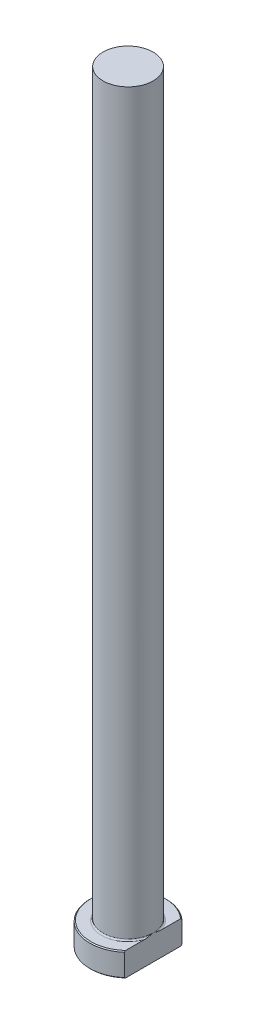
ISO-10303-21;
HEADER;
FILE_DESCRIPTION(('STEP AP214'),'2;1');
FILE_NAME('part.step','',(''),(''),'','','');
FILE_SCHEMA(('AUTOMOTIVE_DESIGN { 1 0 10303 214 1 1 1 1 }'));
ENDSEC;
DATA;
#1=APPLICATION_CONTEXT('core data for automotive mechanical design processes');
#2=APPLICATION_PROTOCOL_DEFINITION('international standard','automotive_design',2000,#1);
#3=PRODUCT_CONTEXT('',#1,'mechanical');
#4=PRODUCT('Part','Part','',(#3));
#5=PRODUCT_RELATED_PRODUCT_CATEGORY('part','',(#4));
#6=PRODUCT_DEFINITION_FORMATION('','',#4);
#7=PRODUCT_DEFINITION_CONTEXT('part definition',#1,'design');
#8=PRODUCT_DEFINITION('design','',#6,#7);
#9=PRODUCT_DEFINITION_SHAPE('','',#8);
#10=(LENGTH_UNIT() NAMED_UNIT(*) SI_UNIT(.MILLI.,.METRE.));
#11=(NAMED_UNIT(*) PLANE_ANGLE_UNIT() SI_UNIT($,.RADIAN.));
#12=(NAMED_UNIT(*) SI_UNIT($,.STERADIAN.) SOLID_ANGLE_UNIT());
#13=UNCERTAINTY_MEASURE_WITH_UNIT(LENGTH_MEASURE(1.E-05),#10,'distance_accuracy_value','');
#14=(GEOMETRIC_REPRESENTATION_CONTEXT(3) GLOBAL_UNCERTAINTY_ASSIGNED_CONTEXT((#13)) GLOBAL_UNIT_ASSIGNED_CONTEXT((#10,
#11,#12)) REPRESENTATION_CONTEXT('',''));
#15=CARTESIAN_POINT('',(0.,0.,0.));
#16=DIRECTION('',(0.,0.,1.));
#17=DIRECTION('',(1.,0.,0.));
#18=AXIS2_PLACEMENT_3D('',#15,#16,#17);
#19=CARTESIAN_POINT('',(0.,0.,0.));
#20=DIRECTION('',(0.,-1.,0.));
#21=DIRECTION('',(0.,0.,-1.));
#22=AXIS2_PLACEMENT_3D('',#19,#20,#21);
#23=PLANE('',#22);
#24=CARTESIAN_POINT('',(0.,0.,0.));
#25=DIRECTION('',(0.,-1.,0.));
#26=DIRECTION('',(0.,0.,-1.));
#27=AXIS2_PLACEMENT_3D('',#24,#25,#26);
#28=CIRCLE('',#27,7.79999999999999);
#29=CARTESIAN_POINT('',(5.24999999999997,0.,5.76866535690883));
#30=VERTEX_POINT('',#29);
#31=CARTESIAN_POINT('',(5.24999999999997,0.,-5.76866535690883));
#32=VERTEX_POINT('',#31);
#33=EDGE_CURVE('E98',#30,#32,#28,.T.);
#34=ORIENTED_EDGE('',*,*,#33,.T.);
#35=DIRECTION('',(0.,0.,1.));
#36=VECTOR('',#35,1.);
#37=CARTESIAN_POINT('',(5.24999999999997,0.,-6.0363482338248));
#38=LINE('',#37,#36);
#39=EDGE_CURVE('E83',#32,#30,#38,.T.);
#40=ORIENTED_EDGE('',*,*,#39,.T.);
#41=EDGE_LOOP('',(#34,#40));
#42=FACE_BOUND('',#41,.T.);
#43=ADVANCED_FACE('F32',(#42),#23,.T.);
#44=CARTESIAN_POINT('',(0.,259.958771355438,0.));
#45=DIRECTION('',(0.,1.,0.));
#46=DIRECTION('',(0.,0.,1.));
#47=AXIS2_PLACEMENT_3D('',#44,#45,#46);
#48=CYLINDRICAL_SURFACE('',#47,7.99999999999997);
#49=CARTESIAN_POINT('',(0.,4.79999999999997,0.));
#50=DIRECTION('',(0.,1.,0.));
#51=DIRECTION('',(0.,0.,1.));
#52=AXIS2_PLACEMENT_3D('',#49,#50,#51);
#53=CIRCLE('',#52,7.99999999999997);
#54=CARTESIAN_POINT('',(5.24999999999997,4.79999999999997,6.0363482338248));
#55=VERTEX_POINT('',#54);
#56=CARTESIAN_POINT('',(5.24999999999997,4.79999999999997,-6.0363482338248));
#57=VERTEX_POINT('',#56);
#58=EDGE_CURVE('E104',#55,#57,#53,.F.);
#59=ORIENTED_EDGE('',*,*,#58,.T.);
#60=DIRECTION('',(0.,-1.,0.));
#61=VECTOR('',#60,1.);
#62=CARTESIAN_POINT('',(5.24999999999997,160.,-6.0363482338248));
#63=LINE('',#62,#61);
#64=CARTESIAN_POINT('',(5.24999999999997,0.199999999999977,-6.0363482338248));
#65=VERTEX_POINT('',#64);
#66=EDGE_CURVE('E183',#57,#65,#63,.T.);
#67=ORIENTED_EDGE('',*,*,#66,.T.);
#68=CARTESIAN_POINT('',(0.,0.199999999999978,0.));
#69=DIRECTION('',(0.,-1.,0.));
#70=DIRECTION('',(0.,0.,-1.));
#71=AXIS2_PLACEMENT_3D('',#68,#69,#70);
#72=CIRCLE('',#71,7.99999999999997);
#73=CARTESIAN_POINT('',(5.24999999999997,0.199999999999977,6.0363482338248));
#74=VERTEX_POINT('',#73);
#75=EDGE_CURVE('E100',#65,#74,#72,.F.);
#76=ORIENTED_EDGE('',*,*,#75,.T.);
#77=DIRECTION('',(0.,-1.,0.));
#78=VECTOR('',#77,1.);
#79=CARTESIAN_POINT('',(5.24999999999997,160.,6.0363482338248));
#80=LINE('',#79,#78);
#81=EDGE_CURVE('E93',#55,#74,#80,.T.);
#82=ORIENTED_EDGE('',*,*,#81,.F.);
#83=EDGE_LOOP('',(#59,#67,#76,#82));
#84=FACE_BOUND('',#83,.T.);
#85=ADVANCED_FACE('F158',(#84),#48,.T.);
#86=CARTESIAN_POINT('',(-7.99999999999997,5.,0.));
#87=DIRECTION('',(0.,1.,0.));
#88=DIRECTION('',(0.,0.,1.));
#89=AXIS2_PLACEMENT_3D('',#86,#87,#88);
#90=PLANE('',#89);
#91=CARTESIAN_POINT('',(0.,5.,0.));
#92=DIRECTION('',(0.,1.,0.));
#93=DIRECTION('',(0.,0.,1.));
#94=AXIS2_PLACEMENT_3D('',#91,#92,#93);
#95=CIRCLE('',#94,7.79999999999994);
#96=CARTESIAN_POINT('',(5.24999999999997,5.,-5.76866535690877));
#97=VERTEX_POINT('',#96);
#98=CARTESIAN_POINT('',(5.24999999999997,5.,5.76866535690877));
#99=VERTEX_POINT('',#98);
#100=EDGE_CURVE('E178',#97,#99,#95,.T.);
#101=ORIENTED_EDGE('',*,*,#100,.T.);
#102=DIRECTION('',(0.,0.,-1.));
#103=VECTOR('',#102,1.);
#104=CARTESIAN_POINT('',(5.24999999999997,5.,0.));
#105=LINE('',#104,#103);
#106=CARTESIAN_POINT('',(5.24999999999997,4.99999999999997,1.79999999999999));
#107=VERTEX_POINT('',#106);
#108=EDGE_CURVE('E57',#99,#107,#105,.T.);
#109=ORIENTED_EDGE('',*,*,#108,.T.);
#110=CARTESIAN_POINT('',(0.,5.,0.));
#111=DIRECTION('',(0.,1.,0.));
#112=DIRECTION('',(0.,0.,1.));
#113=AXIS2_PLACEMENT_3D('',#110,#111,#112);
#114=CIRCLE('',#113,5.54999999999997);
#115=CARTESIAN_POINT('',(5.24999999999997,4.99999999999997,-1.79999999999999));
#116=VERTEX_POINT('',#115);
#117=EDGE_CURVE('E107',#107,#116,#114,.F.);
#118=ORIENTED_EDGE('',*,*,#117,.T.);
#119=EDGE_CURVE('E136',#116,#97,#105,.T.);
#120=ORIENTED_EDGE('',*,*,#119,.T.);
#121=EDGE_LOOP('',(#101,#109,#118,#120));
#122=FACE_BOUND('',#121,.T.);
#123=ADVANCED_FACE('F147',(#122),#90,.T.);
#124=CARTESIAN_POINT('',(0.,5.,0.));
#125=DIRECTION('',(0.,-1.,0.));
#126=DIRECTION('',(0.,0.,-1.));
#127=AXIS2_PLACEMENT_3D('',#124,#125,#126);
#128=CONICAL_SURFACE('',#127,7.79999999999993,0.785398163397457);
#129=ORIENTED_EDGE('',*,*,#58,.F.);
#130=CARTESIAN_POINT('',(5.24999999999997,-1.48116632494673,13.2811600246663));
#131=CARTESIAN_POINT('',(5.24999999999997,-1.29357250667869,13.0794377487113));
#132=CARTESIAN_POINT('',(5.24999999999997,-1.10628451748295,12.8774311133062));
#133=CARTESIAN_POINT('',(5.24999999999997,-0.732415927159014,12.4727618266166));
#134=CARTESIAN_POINT('',(5.24999999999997,-0.545835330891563,12.2700991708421));
#135=CARTESIAN_POINT('',(5.24999999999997,0.0127787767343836,11.6609122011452));
#136=CARTESIAN_POINT('',(5.24999999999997,0.383603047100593,11.2532764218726));
#137=CARTESIAN_POINT('',(5.24999999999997,1.1232534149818,10.431500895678));
#138=CARTESIAN_POINT('',(5.24999999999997,1.49205195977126,10.0173363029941));
#139=CARTESIAN_POINT('',(5.24999999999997,2.22349880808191,9.18368237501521));
#140=CARTESIAN_POINT('',(5.24999999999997,2.58614786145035,8.76419369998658));
#141=CARTESIAN_POINT('',(5.24999999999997,3.23008746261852,8.00331710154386));
#142=CARTESIAN_POINT('',(5.24999999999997,3.5129921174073,7.66330157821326));
#143=CARTESIAN_POINT('',(5.24999999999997,3.93141579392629,7.14837202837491));
#144=CARTESIAN_POINT('',(5.24999999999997,4.06992138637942,6.97588542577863));
#145=CARTESIAN_POINT('',(5.24999999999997,4.34452705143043,6.62901010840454));
#146=CARTESIAN_POINT('',(5.24999999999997,4.48062717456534,6.45462143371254));
#147=CARTESIAN_POINT('',(5.24999999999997,4.74973822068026,6.10383934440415));
#148=CARTESIAN_POINT('',(5.24999999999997,4.88275300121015,5.92744889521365));
#149=CARTESIAN_POINT('',(5.24999999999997,5.14521399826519,5.57203856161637));
#150=CARTESIAN_POINT('',(5.24999999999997,5.27466038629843,5.39301880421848));
#151=CARTESIAN_POINT('',(5.24999999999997,5.52907482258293,5.0319249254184));
#152=CARTESIAN_POINT('',(5.24999999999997,5.6540446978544,4.84985209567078));
#153=CARTESIAN_POINT('',(5.24999999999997,5.8984042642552,4.4820121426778));
#154=CARTESIAN_POINT('',(5.24999999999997,6.01779462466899,4.29624546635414));
#155=CARTESIAN_POINT('',(5.24999999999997,6.24171029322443,3.93290441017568));
#156=CARTESIAN_POINT('',(5.24999999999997,6.34669562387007,3.75561494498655));
#157=CARTESIAN_POINT('',(5.24999999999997,6.54883017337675,3.39656407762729));
#158=CARTESIAN_POINT('',(5.24999999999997,6.64597853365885,3.21480218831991));
#159=CARTESIAN_POINT('',(5.24999999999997,6.83020392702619,2.84629933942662));
#160=CARTESIAN_POINT('',(5.24999999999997,6.91728535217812,2.65956059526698));
#161=CARTESIAN_POINT('',(5.24999999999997,7.07861709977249,2.28058919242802));
#162=CARTESIAN_POINT('',(5.24999999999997,7.15287080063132,2.08835799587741));
#163=CARTESIAN_POINT('',(5.24999999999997,7.27107095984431,1.73993363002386));
#164=CARTESIAN_POINT('',(5.24999999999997,7.31810380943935,1.5847937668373));
#165=CARTESIAN_POINT('',(5.24999999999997,7.40035184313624,1.27142880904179));
#166=CARTESIAN_POINT('',(5.24999999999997,7.43557139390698,1.11320487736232));
#167=CARTESIAN_POINT('',(5.24999999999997,7.4924726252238,0.79484251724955));
#168=CARTESIAN_POINT('',(5.24999999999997,7.51419839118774,0.634712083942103));
#169=CARTESIAN_POINT('',(5.24999999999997,7.54310705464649,0.313132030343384));
#170=CARTESIAN_POINT('',(5.24999999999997,7.55029089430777,0.151682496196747));
#171=CARTESIAN_POINT('',(5.24999999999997,7.54968998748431,-0.17172666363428));
#172=CARTESIAN_POINT('',(5.24999999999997,7.54185529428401,-0.333686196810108));
#173=CARTESIAN_POINT('',(5.24999999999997,7.51158499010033,-0.656223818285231));
#174=CARTESIAN_POINT('',(5.24999999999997,7.48914825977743,-0.816801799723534));
#175=CARTESIAN_POINT('',(5.24999999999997,7.43080718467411,-1.13597880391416));
#176=CARTESIAN_POINT('',(5.24999999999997,7.39486058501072,-1.29456998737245));
#177=CARTESIAN_POINT('',(5.24999999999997,7.31118363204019,-1.60857875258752));
#178=CARTESIAN_POINT('',(5.24999999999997,7.26345259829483,-1.76399615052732));
#179=CARTESIAN_POINT('',(5.24999999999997,7.15315151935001,-2.08548717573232));
#180=CARTESIAN_POINT('',(5.24999999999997,7.08962117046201,-2.25122835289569));
#181=CARTESIAN_POINT('',(5.24999999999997,6.95279918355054,-2.57864196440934));
#182=CARTESIAN_POINT('',(5.24999999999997,6.87950469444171,-2.74031319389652));
#183=CARTESIAN_POINT('',(5.24999999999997,6.72489088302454,-3.06007692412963));
#184=CARTESIAN_POINT('',(5.24999999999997,6.64355831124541,-3.21816296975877));
#185=CARTESIAN_POINT('',(5.24999999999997,6.47449809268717,-3.53083072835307));
#186=CARTESIAN_POINT('',(5.24999999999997,6.38677122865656,-3.68541286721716));
#187=CARTESIAN_POINT('',(5.24999999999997,6.20495786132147,-3.99346169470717));
#188=CARTESIAN_POINT('',(5.24999999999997,6.11080410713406,-4.14688850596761));
#189=CARTESIAN_POINT('',(5.24999999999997,5.91814750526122,-4.45098066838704));
#190=CARTESIAN_POINT('',(5.24999999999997,5.8196445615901,-4.60164595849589));
#191=CARTESIAN_POINT('',(5.24999999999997,5.61916095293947,-4.90042904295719));
#192=CARTESIAN_POINT('',(5.24999999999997,5.51718369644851,-5.04854913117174));
#193=CARTESIAN_POINT('',(5.24999999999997,5.31027155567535,-5.34270095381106));
#194=CARTESIAN_POINT('',(5.24999999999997,5.20533670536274,-5.48873271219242));
#195=CARTESIAN_POINT('',(5.24999999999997,4.97106981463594,-5.80895105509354));
#196=CARTESIAN_POINT('',(5.24999999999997,4.84117419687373,-5.98272485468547));
#197=CARTESIAN_POINT('',(5.24999999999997,4.57844088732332,-6.32803694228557));
#198=CARTESIAN_POINT('',(5.24999999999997,4.44560309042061,-6.49957515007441));
#199=CARTESIAN_POINT('',(5.24999999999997,4.04344241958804,-7.01138747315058));
#200=CARTESIAN_POINT('',(5.24999999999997,3.77050218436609,-7.34881891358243));
#201=CARTESIAN_POINT('',(5.24999999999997,3.21761339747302,-8.01842681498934));
#202=CARTESIAN_POINT('',(5.24999999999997,2.93765803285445,-8.35059761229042));
#203=CARTESIAN_POINT('',(5.24999999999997,2.3728048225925,-9.01071908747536));
#204=CARTESIAN_POINT('',(5.24999999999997,2.08790682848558,-9.338669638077));
#205=CARTESIAN_POINT('',(5.24999999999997,1.53221513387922,-9.97104652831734));
#206=CARTESIAN_POINT('',(5.24999999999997,1.26164416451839,-10.275669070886));
#207=CARTESIAN_POINT('',(5.24999999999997,0.717945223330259,-10.8826342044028));
#208=CARTESIAN_POINT('',(5.24999999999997,0.444817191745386,-11.1849767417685));
#209=CARTESIAN_POINT('',(5.24999999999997,-0.102863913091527,-11.7871569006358));
#210=CARTESIAN_POINT('',(5.24999999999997,-0.377412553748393,-12.0869985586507));
#211=CARTESIAN_POINT('',(5.24999999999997,-0.928148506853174,-12.6851474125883));
#212=CARTESIAN_POINT('',(5.24999999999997,-1.20433574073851,-12.9834546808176));
#213=CARTESIAN_POINT('',(5.24999999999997,-1.48116632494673,-13.2811600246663));
#214=B_SPLINE_CURVE_WITH_KNOTS('',3,(#130,#131,#132,#133,#134,#135,#136,#137,#138,#139,#140,
#141,#142,#143,#144,#145,#146,#147,#148,#149,#150,#151,#152,#153,#154,#155,#156,#157,#158,#159,
#160,#161,#162,#163,#164,#165,#166,#167,#168,#169,#170,#171,#172,#173,#174,#175,#176,#177,#178,
#179,#180,#181,#182,#183,#184,#185,#186,#187,#188,#189,#190,#191,#192,#193,#194,#195,#196,#197,
#198,#199,#200,#201,#202,#203,#204,#205,#206,#207,#208,#209,#210,#211,#212,#213),.UNSPECIFIED.,
.F.,.F.,(4,2,2,2,2,2,2,2,2,2,2,2,2,2,2,2,2,2,2,2,2,2,2,2,2,2,2,2,2,2,2,2,2,2,2,2,2,2,2,2,2,4),
(0.,0.826407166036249,1.65282000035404,3.30600459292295,4.96966514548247,6.63312135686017,
7.95997894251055,8.62360280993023,9.28721271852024,9.94994254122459,10.61264045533,
11.2750647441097,11.937409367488,12.5553811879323,13.1734206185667,13.7911893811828,
14.4087951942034,14.8947423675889,15.3805097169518,15.8646815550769,16.3488220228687,
16.8345753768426,17.3203659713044,17.8076887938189,18.2950397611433,18.8271554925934,
19.3594269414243,19.8925908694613,20.4256896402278,20.9656407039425,21.5056036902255,
22.0450513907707,22.5844928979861,23.2353229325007,23.8861762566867,25.1880335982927,
26.4912084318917,27.7944224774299,29.0167115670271,30.2390292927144,31.4586693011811,
32.6782512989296),.UNSPECIFIED.);
#215=EDGE_CURVE('E135',#55,#99,#214,.T.);
#216=ORIENTED_EDGE('',*,*,#215,.T.);
#217=ORIENTED_EDGE('',*,*,#100,.F.);
#218=EDGE_CURVE('E127',#97,#57,#214,.T.);
#219=ORIENTED_EDGE('',*,*,#218,.T.);
#220=EDGE_LOOP('',(#129,#216,#217,#219));
#221=FACE_BOUND('',#220,.T.);
#222=ADVANCED_FACE('F143',(#221),#128,.T.);
#223=CARTESIAN_POINT('',(0.,0.199999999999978,0.));
#224=DIRECTION('',(0.,1.,0.));
#225=DIRECTION('',(0.,0.,1.));
#226=AXIS2_PLACEMENT_3D('',#223,#224,#225);
#227=CONICAL_SURFACE('',#226,7.99999999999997,0.785398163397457);
#228=ORIENTED_EDGE('',*,*,#75,.F.);
#229=CARTESIAN_POINT('',(5.24999999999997,6.48116632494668,-13.2811600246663));
#230=CARTESIAN_POINT('',(5.24999999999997,6.29357250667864,-13.0794377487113));
#231=CARTESIAN_POINT('',(5.24999999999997,6.1062845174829,-12.8774311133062));
#232=CARTESIAN_POINT('',(5.24999999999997,5.73241592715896,-12.4727618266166));
#233=CARTESIAN_POINT('',(5.24999999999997,5.54583533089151,-12.2700991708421));
#234=CARTESIAN_POINT('',(5.24999999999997,4.98722122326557,-11.6609122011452));
#235=CARTESIAN_POINT('',(5.24999999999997,4.61639695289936,-11.2532764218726));
#236=CARTESIAN_POINT('',(5.24999999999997,3.87674658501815,-10.431500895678));
#237=CARTESIAN_POINT('',(5.24999999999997,3.50794804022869,-10.0173363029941));
#238=CARTESIAN_POINT('',(5.24999999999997,2.77650119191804,-9.18368237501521));
#239=CARTESIAN_POINT('',(5.24999999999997,2.4138521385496,-8.76419369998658));
#240=CARTESIAN_POINT('',(5.24999999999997,1.76991253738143,-8.00331710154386));
#241=CARTESIAN_POINT('',(5.24999999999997,1.48700788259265,-7.66330157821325));
#242=CARTESIAN_POINT('',(5.24999999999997,1.06858420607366,-7.14837202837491));
#243=CARTESIAN_POINT('',(5.24999999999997,0.930078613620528,-6.97588542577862));
#244=CARTESIAN_POINT('',(5.24999999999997,0.655472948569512,-6.62901010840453));
#245=CARTESIAN_POINT('',(5.24999999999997,0.519372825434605,-6.45462143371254));
#246=CARTESIAN_POINT('',(5.24999999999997,0.250261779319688,-6.10383934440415));
#247=CARTESIAN_POINT('',(5.24999999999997,0.117246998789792,-5.92744889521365));
#248=CARTESIAN_POINT('',(5.24999999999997,-0.145213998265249,-5.57203856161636));
#249=CARTESIAN_POINT('',(5.24999999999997,-0.274660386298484,-5.39301880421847));
#250=CARTESIAN_POINT('',(5.24999999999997,-0.529074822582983,-5.03192492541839));
#251=CARTESIAN_POINT('',(5.24999999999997,-0.654044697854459,-4.84985209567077));
#252=CARTESIAN_POINT('',(5.24999999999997,-0.898404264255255,-4.48201214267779));
#253=CARTESIAN_POINT('',(5.24999999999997,-1.01779462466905,-4.29624546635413));
#254=CARTESIAN_POINT('',(5.24999999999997,-1.24171029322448,-3.93290441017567));
#255=CARTESIAN_POINT('',(5.24999999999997,-1.34669562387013,-3.75561494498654));
#256=CARTESIAN_POINT('',(5.24999999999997,-1.5488301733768,-3.39656407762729));
#257=CARTESIAN_POINT('',(5.24999999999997,-1.64597853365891,-3.2148021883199));
#258=CARTESIAN_POINT('',(5.24999999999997,-1.83020392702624,-2.84629933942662));
#259=CARTESIAN_POINT('',(5.24999999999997,-1.91728535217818,-2.65956059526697));
#260=CARTESIAN_POINT('',(5.24999999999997,-2.07861709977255,-2.28058919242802));
#261=CARTESIAN_POINT('',(5.24999999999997,-2.15287080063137,-2.08835799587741));
#262=CARTESIAN_POINT('',(5.24999999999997,-2.27107095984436,-1.73993363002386));
#263=CARTESIAN_POINT('',(5.24999999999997,-2.31810380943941,-1.5847937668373));
#264=CARTESIAN_POINT('',(5.24999999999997,-2.40035184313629,-1.27142880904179));
#265=CARTESIAN_POINT('',(5.24999999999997,-2.43557139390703,-1.11320487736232));
#266=CARTESIAN_POINT('',(5.24999999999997,-2.49247262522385,-0.794842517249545));
#267=CARTESIAN_POINT('',(5.24999999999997,-2.51419839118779,-0.634712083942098));
#268=CARTESIAN_POINT('',(5.24999999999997,-2.54310705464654,-0.313132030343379));
#269=CARTESIAN_POINT('',(5.24999999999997,-2.55029089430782,-0.151682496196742));
#270=CARTESIAN_POINT('',(5.24999999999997,-2.54968998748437,0.171726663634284));
#271=CARTESIAN_POINT('',(5.24999999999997,-2.54185529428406,0.333686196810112));
#272=CARTESIAN_POINT('',(5.24999999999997,-2.51158499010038,0.656223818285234));
#273=CARTESIAN_POINT('',(5.24999999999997,-2.48914825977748,0.816801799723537));
#274=CARTESIAN_POINT('',(5.24999999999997,-2.43080718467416,1.13597880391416));
#275=CARTESIAN_POINT('',(5.24999999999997,-2.39486058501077,1.29456998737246));
#276=CARTESIAN_POINT('',(5.24999999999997,-2.31118363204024,1.60857875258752));
#277=CARTESIAN_POINT('',(5.24999999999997,-2.26345259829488,1.76399615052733));
#278=CARTESIAN_POINT('',(5.24999999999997,-2.15315151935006,2.08548717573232));
#279=CARTESIAN_POINT('',(5.24999999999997,-2.08962117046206,2.25122835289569));
#280=CARTESIAN_POINT('',(5.24999999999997,-1.95279918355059,2.57864196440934));
#281=CARTESIAN_POINT('',(5.24999999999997,-1.87950469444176,2.74031319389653));
#282=CARTESIAN_POINT('',(5.24999999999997,-1.72489088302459,3.06007692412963));
#283=CARTESIAN_POINT('',(5.24999999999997,-1.64355831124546,3.21816296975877));
#284=CARTESIAN_POINT('',(5.24999999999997,-1.47449809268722,3.53083072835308));
#285=CARTESIAN_POINT('',(5.24999999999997,-1.38677122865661,3.68541286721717));
#286=CARTESIAN_POINT('',(5.24999999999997,-1.20495786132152,3.99346169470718));
#287=CARTESIAN_POINT('',(5.24999999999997,-1.11080410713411,4.14688850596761));
#288=CARTESIAN_POINT('',(5.24999999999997,-0.918147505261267,4.45098066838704));
#289=CARTESIAN_POINT('',(5.24999999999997,-0.819644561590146,4.6016459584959));
#290=CARTESIAN_POINT('',(5.24999999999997,-0.619160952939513,4.90042904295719));
#291=CARTESIAN_POINT('',(5.24999999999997,-0.51718369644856,5.04854913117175));
#292=CARTESIAN_POINT('',(5.24999999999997,-0.310271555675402,5.34270095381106));
#293=CARTESIAN_POINT('',(5.24999999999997,-0.205336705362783,5.48873271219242));
#294=CARTESIAN_POINT('',(5.24999999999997,0.0289301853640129,5.80895105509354));
#295=CARTESIAN_POINT('',(5.24999999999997,0.158825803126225,5.98272485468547));
#296=CARTESIAN_POINT('',(5.24999999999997,0.421559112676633,6.32803694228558));
#297=CARTESIAN_POINT('',(5.24999999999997,0.554396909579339,6.49957515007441));
#298=CARTESIAN_POINT('',(5.24999999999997,0.956557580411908,7.01138747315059));
#299=CARTESIAN_POINT('',(5.24999999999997,1.22949781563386,7.34881891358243));
#300=CARTESIAN_POINT('',(5.24999999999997,1.78238660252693,8.01842681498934));
#301=CARTESIAN_POINT('',(5.24999999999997,2.0623419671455,8.35059761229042));
#302=CARTESIAN_POINT('',(5.24999999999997,2.62719517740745,9.01071908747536));
#303=CARTESIAN_POINT('',(5.24999999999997,2.91209317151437,9.338669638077));
#304=CARTESIAN_POINT('',(5.24999999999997,3.46778486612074,9.97104652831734));
#305=CARTESIAN_POINT('',(5.24999999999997,3.73835583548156,10.275669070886));
#306=CARTESIAN_POINT('',(5.24999999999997,4.28205477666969,10.8826342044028));
#307=CARTESIAN_POINT('',(5.24999999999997,4.55518280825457,11.1849767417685));
#308=CARTESIAN_POINT('',(5.24999999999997,5.10286391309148,11.7871569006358));
#309=CARTESIAN_POINT('',(5.24999999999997,5.37741255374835,12.0869985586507));
#310=CARTESIAN_POINT('',(5.24999999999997,5.92814850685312,12.6851474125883));
#311=CARTESIAN_POINT('',(5.24999999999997,6.20433574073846,12.9834546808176));
#312=CARTESIAN_POINT('',(5.24999999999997,6.48116632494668,13.2811600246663));
#313=B_SPLINE_CURVE_WITH_KNOTS('',3,(#229,#230,#231,#232,#233,#234,#235,#236,#237,#238,#239,
#240,#241,#242,#243,#244,#245,#246,#247,#248,#249,#250,#251,#252,#253,#254,#255,#256,#257,#258,
#259,#260,#261,#262,#263,#264,#265,#266,#267,#268,#269,#270,#271,#272,#273,#274,#275,#276,#277,
#278,#279,#280,#281,#282,#283,#284,#285,#286,#287,#288,#289,#290,#291,#292,#293,#294,#295,#296,
#297,#298,#299,#300,#301,#302,#303,#304,#305,#306,#307,#308,#309,#310,#311,#312),.UNSPECIFIED.,
.F.,.F.,(4,2,2,2,2,2,2,2,2,2,2,2,2,2,2,2,2,2,2,2,2,2,2,2,2,2,2,2,2,2,2,2,2,2,2,2,2,2,2,2,2,4),
(0.,0.826407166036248,1.65282000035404,3.30600459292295,4.96966514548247,6.63312135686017,
7.95997894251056,8.62360280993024,9.28721271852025,9.9499425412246,10.61264045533,
11.2750647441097,11.937409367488,12.5553811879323,13.1734206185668,13.7911893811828,
14.4087951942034,14.8947423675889,15.3805097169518,15.8646815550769,16.3488220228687,
16.8345753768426,17.3203659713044,17.8076887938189,18.2950397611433,18.8271554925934,
19.3594269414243,19.8925908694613,20.4256896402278,20.9656407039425,21.5056036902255,
22.0450513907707,22.5844928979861,23.2353229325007,23.8861762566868,25.1880335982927,
26.4912084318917,27.7944224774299,29.0167115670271,30.2390292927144,31.4586693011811,
32.6782512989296),.UNSPECIFIED.);
#314=EDGE_CURVE('E86',#65,#32,#313,.T.);
#315=ORIENTED_EDGE('',*,*,#314,.T.);
#316=ORIENTED_EDGE('',*,*,#33,.F.);
#317=EDGE_CURVE('E89',#30,#74,#313,.T.);
#318=ORIENTED_EDGE('',*,*,#317,.T.);
#319=EDGE_LOOP('',(#228,#315,#316,#318));
#320=FACE_BOUND('',#319,.T.);
#321=ADVANCED_FACE('F97',(#320),#227,.T.);
#322=CARTESIAN_POINT('',(0.,5.29999999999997,0.));
#323=DIRECTION('',(0.,1.,0.));
#324=DIRECTION('',(0.,0.,1.));
#325=AXIS2_PLACEMENT_3D('',#322,#323,#324);
#326=TOROIDAL_SURFACE('',#325,5.54999999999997,0.3);
#327=CARTESIAN_POINT('',(5.24999999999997,5.29999999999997,0.));
#328=CARTESIAN_POINT('',(5.24999999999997,5.30000062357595,1.16656166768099E-10));
#329=CARTESIAN_POINT('',(5.24999999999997,5.30000124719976,-2.61240012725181E-07));
#330=CARTESIAN_POINT('',(5.24999999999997,5.30000240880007,-9.73737247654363E-07));
#331=CARTESIAN_POINT('',(5.24999999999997,5.3000029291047,-1.44300381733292E-06));
#332=CARTESIAN_POINT('',(5.24999999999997,5.30000402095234,-2.56984529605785E-06));
#333=CARTESIAN_POINT('',(5.24999999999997,5.30000457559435,-3.24572224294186E-06));
#334=CARTESIAN_POINT('',(5.24999999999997,5.30000555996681,-4.63899443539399E-06));
#335=CARTESIAN_POINT('',(5.24999999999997,5.30000599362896,-5.35385174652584E-06));
#336=CARTESIAN_POINT('',(5.24999999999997,5.30000762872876,-8.15275638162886E-06));
#337=CARTESIAN_POINT('',(5.24999999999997,5.30000874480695,-1.02903375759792E-05));
#338=CARTESIAN_POINT('',(5.24999999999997,5.30001055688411,-1.44997307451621E-05));
#339=CARTESIAN_POINT('',(5.24999999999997,5.30001128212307,-1.65594410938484E-05));
#340=CARTESIAN_POINT('',(5.24999999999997,5.30001436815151,-2.53621688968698E-05));
#341=CARTESIAN_POINT('',(5.24999999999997,5.30001670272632,-3.21176555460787E-05));
#342=CARTESIAN_POINT('',(5.24999999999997,5.30002009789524,-4.48185660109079E-05));
#343=CARTESIAN_POINT('',(5.24999999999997,5.30002130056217,-5.07256098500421E-05));
#344=CARTESIAN_POINT('',(5.24999999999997,5.300030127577,-9.48741140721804E-05));
#345=CARTESIAN_POINT('',(5.24999999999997,5.30003689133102,-0.000133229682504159));
#346=CARTESIAN_POINT('',(5.24999999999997,5.30006649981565,-0.00028531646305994));
#347=CARTESIAN_POINT('',(5.24999999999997,5.30009467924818,-0.000398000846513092));
#348=CARTESIAN_POINT('',(5.24999999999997,5.30020485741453,-0.000845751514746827));
#349=CARTESIAN_POINT('',(5.24999999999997,5.30028346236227,-0.00118137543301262));
#350=CARTESIAN_POINT('',(5.24999999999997,5.30059922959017,-0.00251998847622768));
#351=CARTESIAN_POINT('',(5.24999999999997,5.30084070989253,-0.0035222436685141));
#352=CARTESIAN_POINT('',(5.24999999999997,5.3018480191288,-0.00771382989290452));
#353=CARTESIAN_POINT('',(5.24999999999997,5.30260840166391,-0.0109040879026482));
#354=CARTESIAN_POINT('',(5.24999999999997,5.30980219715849,-0.0410723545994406));
#355=CARTESIAN_POINT('',(5.24999999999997,5.31625953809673,-0.0680464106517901));
#356=CARTESIAN_POINT('',(5.24999999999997,5.32887570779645,-0.120910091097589));
#357=CARTESIAN_POINT('',(5.24999999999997,5.33503603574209,-0.146799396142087));
#358=CARTESIAN_POINT('',(5.24999999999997,5.34810832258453,-0.201908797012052));
#359=CARTESIAN_POINT('',(5.24999999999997,5.35501531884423,-0.231130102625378));
#360=CARTESIAN_POINT('',(5.24999999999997,5.3688279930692,-0.289915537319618));
#361=CARTESIAN_POINT('',(5.24999999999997,5.37573280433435,-0.31947986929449));
#362=CARTESIAN_POINT('',(5.24999999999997,5.39233240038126,-0.391129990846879));
#363=CARTESIAN_POINT('',(5.24999999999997,5.40197331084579,-0.433228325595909));
#364=CARTESIAN_POINT('',(5.24999999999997,5.42071775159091,-0.516417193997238));
#365=CARTESIAN_POINT('',(5.24999999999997,5.42982871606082,-0.557506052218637));
#366=CARTESIAN_POINT('',(5.24999999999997,5.45024545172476,-0.651521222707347));
#367=CARTESIAN_POINT('',(5.24999999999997,5.46143398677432,-0.70447326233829));
#368=CARTESIAN_POINT('',(5.24999999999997,5.48311687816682,-0.810941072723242));
#369=CARTESIAN_POINT('',(5.24999999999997,5.49360525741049,-0.864458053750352));
#370=CARTESIAN_POINT('',(5.24999999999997,5.5252275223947,-1.03405951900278));
#371=CARTESIAN_POINT('',(5.24999999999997,5.54454970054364,-1.15049679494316));
#372=CARTESIAN_POINT('',(5.24999999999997,5.57371765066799,-1.36731361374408));
#373=CARTESIAN_POINT('',(5.24999999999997,5.58453543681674,-1.4675540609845));
#374=CARTESIAN_POINT('',(5.24999999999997,5.59494335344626,-1.61734655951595));
#375=CARTESIAN_POINT('',(5.24999999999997,5.5974458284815,-1.66669122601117));
#376=CARTESIAN_POINT('',(5.24999999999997,5.60018139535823,-1.76542367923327));
#377=CARTESIAN_POINT('',(5.24999999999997,5.60041538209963,-1.81481144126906));
#378=CARTESIAN_POINT('',(5.24999999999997,5.59770699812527,-1.92992281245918));
#379=CARTESIAN_POINT('',(5.24999999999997,5.59368653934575,-1.99563731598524));
#380=CARTESIAN_POINT('',(5.24999999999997,5.58239535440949,-2.09375112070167));
#381=CARTESIAN_POINT('',(5.24999999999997,5.5777387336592,-2.12645109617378));
#382=CARTESIAN_POINT('',(5.24999999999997,5.56623568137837,-2.19145637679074));
#383=CARTESIAN_POINT('',(5.24999999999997,5.55939081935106,-2.22376194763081));
#384=CARTESIAN_POINT('',(5.24999999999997,5.54289171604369,-2.28774017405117));
#385=CARTESIAN_POINT('',(5.24999999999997,5.53323089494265,-2.31941115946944));
#386=CARTESIAN_POINT('',(5.24999999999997,5.5101870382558,-2.38130147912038));
#387=CARTESIAN_POINT('',(5.24999999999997,5.49682279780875,-2.41152726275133));
#388=CARTESIAN_POINT('',(5.24999999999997,5.47383686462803,-2.45267588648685));
#389=CARTESIAN_POINT('',(5.24999999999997,5.46640062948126,-2.46481176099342));
#390=CARTESIAN_POINT('',(5.24999999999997,5.45028535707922,-2.48829012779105));
#391=CARTESIAN_POINT('',(5.24999999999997,5.44160336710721,-2.49963063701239));
#392=CARTESIAN_POINT('',(5.24999999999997,5.42264067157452,-2.52121093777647));
#393=CARTESIAN_POINT('',(5.24999999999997,5.41233846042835,-2.53143222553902));
#394=CARTESIAN_POINT('',(5.24999999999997,5.39001295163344,-2.54977752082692));
#395=CARTESIAN_POINT('',(5.24999999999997,5.3779990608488,-2.55791235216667));
#396=CARTESIAN_POINT('',(5.24999999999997,5.35800000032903,-2.56805143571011));
#397=CARTESIAN_POINT('',(5.24999999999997,5.3505843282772,-2.57117564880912));
#398=CARTESIAN_POINT('',(5.24999999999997,5.33534289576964,-2.57618429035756));
#399=CARTESIAN_POINT('',(5.24999999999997,5.32751754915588,-2.57806994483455));
#400=CARTESIAN_POINT('',(5.24999999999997,5.311605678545,-2.58043009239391));
#401=CARTESIAN_POINT('',(5.24999999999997,5.3035179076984,-2.58089637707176));
#402=CARTESIAN_POINT('',(5.24999999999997,5.28739280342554,-2.58034271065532));
#403=CARTESIAN_POINT('',(5.24999999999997,5.27935547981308,-2.5793224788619));
#404=CARTESIAN_POINT('',(5.24999999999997,5.2641286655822,-2.576023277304));
#405=CARTESIAN_POINT('',(5.24999999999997,5.25691883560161,-2.57383545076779));
#406=CARTESIAN_POINT('',(5.24999999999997,5.24289768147,-2.56843751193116));
#407=CARTESIAN_POINT('',(5.24999999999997,5.23608651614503,-2.5652269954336));
#408=CARTESIAN_POINT('',(5.24999999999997,5.21908960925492,-2.55585712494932));
#409=CARTESIAN_POINT('',(5.24999999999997,5.20925106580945,-2.54906973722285));
#410=CARTESIAN_POINT('',(5.24999999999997,5.19074002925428,-2.53405361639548));
#411=CARTESIAN_POINT('',(5.24999999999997,5.1820713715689,-2.52582033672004));
#412=CARTESIAN_POINT('',(5.24999999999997,5.15973027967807,-2.50189565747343));
#413=CARTESIAN_POINT('',(5.24999999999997,5.14713154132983,-2.4852116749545));
#414=CARTESIAN_POINT('',(5.24999999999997,5.12441873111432,-2.45028247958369));
#415=CARTESIAN_POINT('',(5.24999999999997,5.11430835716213,-2.43203499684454));
#416=CARTESIAN_POINT('',(5.24999999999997,5.095460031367,-2.39348631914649));
#417=CARTESIAN_POINT('',(5.24999999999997,5.08684143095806,-2.3731276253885));
#418=CARTESIAN_POINT('',(5.24999999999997,5.07130293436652,-2.33176174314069));
#419=CARTESIAN_POINT('',(5.24999999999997,5.0643850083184,-2.31075383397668));
#420=CARTESIAN_POINT('',(5.24999999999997,5.05188132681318,-2.26814065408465));
#421=CARTESIAN_POINT('',(5.24999999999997,5.04630843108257,-2.24653166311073));
#422=CARTESIAN_POINT('',(5.24999999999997,5.036346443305,-2.20306277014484));
#423=CARTESIAN_POINT('',(5.24999999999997,5.03195656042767,-2.18120304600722));
#424=CARTESIAN_POINT('',(5.24999999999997,5.02182394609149,-2.12403914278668));
#425=CARTESIAN_POINT('',(5.24999999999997,5.01686753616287,-2.08859566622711));
#426=CARTESIAN_POINT('',(5.24999999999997,5.00900730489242,-2.01747645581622));
#427=CARTESIAN_POINT('',(5.24999999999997,5.0061045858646,-1.98180060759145));
#428=CARTESIAN_POINT('',(5.24999999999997,4.99990490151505,-1.87441007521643));
#429=CARTESIAN_POINT('',(5.24999999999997,4.99914942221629,-1.80254846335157));
#430=CARTESIAN_POINT('',(5.24999999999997,5.00239161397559,-1.66261916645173));
#431=CARTESIAN_POINT('',(5.24999999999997,5.00615102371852,-1.59454326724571));
#432=CARTESIAN_POINT('',(5.24999999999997,5.0170133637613,-1.45862908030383));
#433=CARTESIAN_POINT('',(5.24999999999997,5.02411815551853,-1.39079094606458));
#434=CARTESIAN_POINT('',(5.24999999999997,5.04416126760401,-1.22927166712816));
#435=CARTESIAN_POINT('',(5.24999999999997,5.05829298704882,-1.1357414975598));
#436=CARTESIAN_POINT('',(5.24999999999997,5.08230499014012,-0.994796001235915));
#437=CARTESIAN_POINT('',(5.24999999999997,5.09089456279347,-0.947150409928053));
#438=CARTESIAN_POINT('',(5.24999999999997,5.10886306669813,-0.851871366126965));
#439=CARTESIAN_POINT('',(5.24999999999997,5.11824411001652,-0.804238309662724));
#440=CARTESIAN_POINT('',(5.24999999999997,5.141356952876,-0.690797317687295));
#441=CARTESIAN_POINT('',(5.24999999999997,5.15537399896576,-0.625047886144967));
#442=CARTESIAN_POINT('',(5.24999999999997,5.18409655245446,-0.494483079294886));
#443=CARTESIAN_POINT('',(5.24999999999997,5.19879244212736,-0.429665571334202));
#444=CARTESIAN_POINT('',(5.24999999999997,5.22697974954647,-0.307614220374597));
#445=CARTESIAN_POINT('',(5.24999999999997,5.24041481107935,-0.250367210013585));
#446=CARTESIAN_POINT('',(5.24999999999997,5.26812039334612,-0.133445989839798));
#447=CARTESIAN_POINT('',(5.24999999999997,5.28240186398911,-0.0737742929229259));
#448=CARTESIAN_POINT('',(5.24999999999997,5.29739294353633,-0.0108979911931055));
#449=CARTESIAN_POINT('',(5.24999999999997,5.2981548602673,-0.00770166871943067));
#450=CARTESIAN_POINT('',(5.24999999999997,5.29916252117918,-0.00350872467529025));
#451=CARTESIAN_POINT('',(5.24999999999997,5.29940286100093,-0.0025111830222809));
#452=CARTESIAN_POINT('',(5.24999999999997,5.299717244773,-0.00117843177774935));
#453=CARTESIAN_POINT('',(5.24999999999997,5.2997955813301,-0.000843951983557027));
#454=CARTESIAN_POINT('',(5.24999999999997,5.29990543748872,-0.000397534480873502));
#455=CARTESIAN_POINT('',(5.24999999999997,5.29993357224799,-0.000285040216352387));
#456=CARTESIAN_POINT('',(5.24999999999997,5.29996313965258,-0.000133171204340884));
#457=CARTESIAN_POINT('',(5.24999999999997,5.29996989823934,-9.48416473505E-05));
#458=CARTESIAN_POINT('',(5.24999999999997,5.29997871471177,-5.07197787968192E-05));
#459=CARTESIAN_POINT('',(5.24999999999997,5.29997991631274,-4.48141195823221E-05));
#460=CARTESIAN_POINT('',(5.24999999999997,5.29998330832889,-3.21161025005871E-05));
#461=CARTESIAN_POINT('',(5.24999999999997,5.29998564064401,-2.53620513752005E-05));
#462=CARTESIAN_POINT('',(5.24999999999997,5.29998872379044,-1.65608283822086E-05));
#463=CARTESIAN_POINT('',(5.24999999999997,5.29998944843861,-1.4501220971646E-05));
#464=CARTESIAN_POINT('',(5.24999999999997,5.29999125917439,-1.02919418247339E-05));
#465=CARTESIAN_POINT('',(5.24999999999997,5.29999237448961,-8.15435788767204E-06));
#466=CARTESIAN_POINT('',(5.24999999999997,5.29999400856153,-5.35534366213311E-06));
#467=CARTESIAN_POINT('',(5.24999999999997,5.29999444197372,-4.6404252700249E-06));
#468=CARTESIAN_POINT('',(5.24999999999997,5.2999954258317,-3.24698579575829E-06));
#469=CARTESIAN_POINT('',(5.24999999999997,5.29999598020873,-2.57100068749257E-06));
#470=CARTESIAN_POINT('',(5.24999999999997,5.29999707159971,-1.44390781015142E-06));
#471=CARTESIAN_POINT('',(5.24999999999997,5.29999759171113,-9.74508164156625E-07));
#472=CARTESIAN_POINT('',(5.24999999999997,5.29999875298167,-2.61670627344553E-07));
#473=CARTESIAN_POINT('',(5.24999999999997,5.29999937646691,-1.166481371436E-10));
#474=CARTESIAN_POINT('',(5.24999999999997,5.29999999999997,0.));
#475=B_SPLINE_CURVE_WITH_KNOTS('',3,(#327,#328,#329,#330,#331,#332,#333,#334,#335,#336,#337,
#338,#339,#340,#341,#342,#343,#344,#345,#346,#347,#348,#349,#350,#351,#352,#353,#354,#355,#356,
#357,#358,#359,#360,#361,#362,#363,#364,#365,#366,#367,#368,#369,#370,#371,#372,#373,#374,#375,
#376,#377,#378,#379,#380,#381,#382,#383,#384,#385,#386,#387,#388,#389,#390,#391,#392,#393,#394,
#395,#396,#397,#398,#399,#400,#401,#402,#403,#404,#405,#406,#407,#408,#409,#410,#411,#412,#413,
#414,#415,#416,#417,#418,#419,#420,#421,#422,#423,#424,#425,#426,#427,#428,#429,#430,#431,#432,
#433,#434,#435,#436,#437,#438,#439,#440,#441,#442,#443,#444,#445,#446,#447,#448,#449,#450,#451,
#452,#453,#454,#455,#456,#457,#458,#459,#460,#461,#462,#463,#464,#465,#466,#467,#468,#469,#470,
#471,#472,#473,#474),.UNSPECIFIED.,.T.,.F.,(4,2,2,2,2,2,2,2,2,2,2,2,2,2,2,2,2,2,2,2,2,2,2,2,2,2,
2,2,2,2,2,2,2,2,2,2,2,2,2,2,2,2,2,2,2,2,2,2,2,2,2,2,2,2,2,2,2,2,2,2,2,2,2,2,2,2,2,2,2,2,2,2,2,
4),(0.,1.89392886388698E-06,4.00212801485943E-06,6.60801824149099E-06,9.1153264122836E-06,
1.63248449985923E-05,2.28697708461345E-05,4.42789050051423E-05,6.23424765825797E-05,
0.000179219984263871,0.00052739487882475,0.00156181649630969,0.00465425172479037,
0.0144935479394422,0.0976999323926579,0.177536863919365,0.267616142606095,0.358695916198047,
0.488259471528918,0.61451916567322,0.776877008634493,0.940479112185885,1.29442390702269,
1.59666224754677,1.74484158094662,1.89296245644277,2.09015926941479,2.18919604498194,
2.28816194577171,2.38736097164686,2.48606549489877,2.528709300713,2.57145590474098,
2.61482708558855,2.65796850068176,2.68202106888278,2.70604979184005,2.73021721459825,
2.75438920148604,2.77690311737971,2.79942594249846,2.8350772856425,2.87084280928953,
2.93320923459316,2.99566778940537,3.06188854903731,3.12818566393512,3.19509354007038,
3.26195657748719,3.36923775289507,3.47657646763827,3.69190663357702,3.8963555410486,
4.10091834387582,4.38458684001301,4.52982429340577,4.6754623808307,4.87713507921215,
5.0765191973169,5.25292680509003,5.43699224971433,5.44685029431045,5.44992818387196,
5.45095907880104,5.45130666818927,5.4514234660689,5.45144152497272,5.45146292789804,
5.45146947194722,5.45147668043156,5.45147918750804,5.45148179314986,5.45148390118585,
5.45148579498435),.UNSPECIFIED.);
#476=CARTESIAN_POINT('',(5.24999999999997,5.29999999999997,0.));
#477=VERTEX_POINT('',#476);
#478=EDGE_CURVE('E11',#116,#477,#475,.T.);
#479=ORIENTED_EDGE('',*,*,#478,.F.);
#480=ORIENTED_EDGE('',*,*,#117,.F.);
#481=CARTESIAN_POINT('',(5.24999999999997,5.29999999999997,0.));
#482=CARTESIAN_POINT('',(5.24999999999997,5.29999937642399,-1.16656200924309E-10));
#483=CARTESIAN_POINT('',(5.24999999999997,5.29999875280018,2.61240012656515E-07));
#484=CARTESIAN_POINT('',(5.24999999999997,5.29999759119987,9.73737247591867E-07));
#485=CARTESIAN_POINT('',(5.24999999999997,5.29999707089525,1.44300381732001E-06));
#486=CARTESIAN_POINT('',(5.24999999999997,5.2999959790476,2.56984529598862E-06));
#487=CARTESIAN_POINT('',(5.24999999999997,5.29999542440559,3.2457222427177E-06));
#488=CARTESIAN_POINT('',(5.24999999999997,5.29999444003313,4.63899443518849E-06));
#489=CARTESIAN_POINT('',(5.24999999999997,5.29999400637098,5.35385174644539E-06));
#490=CARTESIAN_POINT('',(5.24999999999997,5.29999237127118,8.15275638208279E-06));
#491=CARTESIAN_POINT('',(5.24999999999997,5.29999125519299,1.02903375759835E-05));
#492=CARTESIAN_POINT('',(5.24999999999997,5.29998944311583,1.44997307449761E-05));
#493=CARTESIAN_POINT('',(5.24999999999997,5.29998871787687,1.65594410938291E-05));
#494=CARTESIAN_POINT('',(5.24999999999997,5.29998563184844,2.53621688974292E-05));
#495=CARTESIAN_POINT('',(5.24999999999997,5.29998329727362,3.21176555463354E-05));
#496=CARTESIAN_POINT('',(5.24999999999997,5.29997990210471,4.48185660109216E-05));
#497=CARTESIAN_POINT('',(5.24999999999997,5.29997869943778,5.07256098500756E-05));
#498=CARTESIAN_POINT('',(5.24999999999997,5.29996987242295,9.4874114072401E-05));
#499=CARTESIAN_POINT('',(5.24999999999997,5.29996310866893,0.000133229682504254));
#500=CARTESIAN_POINT('',(5.24999999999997,5.29993350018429,0.000285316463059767));
#501=CARTESIAN_POINT('',(5.24999999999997,5.29990532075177,0.000398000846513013));
#502=CARTESIAN_POINT('',(5.24999999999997,5.29979514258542,0.000845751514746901));
#503=CARTESIAN_POINT('',(5.24999999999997,5.29971653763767,0.00118137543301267));
#504=CARTESIAN_POINT('',(5.24999999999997,5.29940077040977,0.00251998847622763));
#505=CARTESIAN_POINT('',(5.24999999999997,5.29915929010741,0.00352224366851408));
#506=CARTESIAN_POINT('',(5.24999999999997,5.29815198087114,0.0077138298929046));
#507=CARTESIAN_POINT('',(5.24999999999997,5.29739159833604,0.0109040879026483));
#508=CARTESIAN_POINT('',(5.24999999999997,5.29019780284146,0.0410723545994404));
#509=CARTESIAN_POINT('',(5.24999999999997,5.28374046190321,0.0680464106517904));
#510=CARTESIAN_POINT('',(5.24999999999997,5.27112429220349,0.12091009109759));
#511=CARTESIAN_POINT('',(5.24999999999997,5.26496396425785,0.146799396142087));
#512=CARTESIAN_POINT('',(5.24999999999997,5.25189167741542,0.201908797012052));
#513=CARTESIAN_POINT('',(5.24999999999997,5.24498468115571,0.231130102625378));
#514=CARTESIAN_POINT('',(5.24999999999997,5.23117200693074,0.289915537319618));
#515=CARTESIAN_POINT('',(5.24999999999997,5.22426719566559,0.31947986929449));
#516=CARTESIAN_POINT('',(5.24999999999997,5.20766759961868,0.391129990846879));
#517=CARTESIAN_POINT('',(5.24999999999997,5.19802668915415,0.433228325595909));
#518=CARTESIAN_POINT('',(5.24999999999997,5.17928224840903,0.516417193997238));
#519=CARTESIAN_POINT('',(5.24999999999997,5.17017128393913,0.557506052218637));
#520=CARTESIAN_POINT('',(5.24999999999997,5.14975454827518,0.651521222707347));
#521=CARTESIAN_POINT('',(5.24999999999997,5.13856601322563,0.70447326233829));
#522=CARTESIAN_POINT('',(5.24999999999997,5.11688312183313,0.810941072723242));
#523=CARTESIAN_POINT('',(5.24999999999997,5.10639474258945,0.864458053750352));
#524=CARTESIAN_POINT('',(5.24999999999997,5.07477247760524,1.03405951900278));
#525=CARTESIAN_POINT('',(5.24999999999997,5.05545029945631,1.15049679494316));
#526=CARTESIAN_POINT('',(5.24999999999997,5.02628234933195,1.36731361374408));
#527=CARTESIAN_POINT('',(5.24999999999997,5.0154645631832,1.4675540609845));
#528=CARTESIAN_POINT('',(5.24999999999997,5.00505664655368,1.61734655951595));
#529=CARTESIAN_POINT('',(5.24999999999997,5.00255417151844,1.66669122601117));
#530=CARTESIAN_POINT('',(5.24999999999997,4.99981860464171,1.76542367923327));
#531=CARTESIAN_POINT('',(5.24999999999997,4.99958461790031,1.81481144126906));
#532=CARTESIAN_POINT('',(5.24999999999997,5.00229300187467,1.92992281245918));
#533=CARTESIAN_POINT('',(5.24999999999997,5.00631346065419,1.99563731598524));
#534=CARTESIAN_POINT('',(5.24999999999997,5.01760464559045,2.09375112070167));
#535=CARTESIAN_POINT('',(5.24999999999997,5.02226126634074,2.12645109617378));
#536=CARTESIAN_POINT('',(5.24999999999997,5.03376431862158,2.19145637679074));
#537=CARTESIAN_POINT('',(5.24999999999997,5.04060918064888,2.22376194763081));
#538=CARTESIAN_POINT('',(5.24999999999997,5.05710828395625,2.28774017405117));
#539=CARTESIAN_POINT('',(5.24999999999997,5.0667691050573,2.31941115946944));
#540=CARTESIAN_POINT('',(5.24999999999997,5.08981296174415,2.38130147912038));
#541=CARTESIAN_POINT('',(5.24999999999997,5.10317720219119,2.41152726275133));
#542=CARTESIAN_POINT('',(5.24999999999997,5.12616313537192,2.45267588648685));
#543=CARTESIAN_POINT('',(5.24999999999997,5.13359937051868,2.46481176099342));
#544=CARTESIAN_POINT('',(5.24999999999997,5.14971464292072,2.48829012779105));
#545=CARTESIAN_POINT('',(5.24999999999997,5.15839663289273,2.49963063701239));
#546=CARTESIAN_POINT('',(5.24999999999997,5.17735932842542,2.52121093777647));
#547=CARTESIAN_POINT('',(5.24999999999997,5.1876615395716,2.53143222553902));
#548=CARTESIAN_POINT('',(5.24999999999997,5.2099870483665,2.54977752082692));
#549=CARTESIAN_POINT('',(5.24999999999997,5.22200093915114,2.55791235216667));
#550=CARTESIAN_POINT('',(5.24999999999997,5.24199999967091,2.56805143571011));
#551=CARTESIAN_POINT('',(5.24999999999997,5.24941567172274,2.57117564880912));
#552=CARTESIAN_POINT('',(5.24999999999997,5.26465710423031,2.57618429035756));
#553=CARTESIAN_POINT('',(5.24999999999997,5.27248245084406,2.57806994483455));
#554=CARTESIAN_POINT('',(5.24999999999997,5.28839432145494,2.58043009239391));
#555=CARTESIAN_POINT('',(5.24999999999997,5.29648209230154,2.58089637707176));
#556=CARTESIAN_POINT('',(5.24999999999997,5.3126071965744,2.58034271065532));
#557=CARTESIAN_POINT('',(5.24999999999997,5.32064452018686,2.5793224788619));
#558=CARTESIAN_POINT('',(5.24999999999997,5.33587133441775,2.576023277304));
#559=CARTESIAN_POINT('',(5.24999999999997,5.34308116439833,2.57383545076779));
#560=CARTESIAN_POINT('',(5.24999999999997,5.35710231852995,2.56843751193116));
#561=CARTESIAN_POINT('',(5.24999999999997,5.36391348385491,2.5652269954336));
#562=CARTESIAN_POINT('',(5.24999999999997,5.38091039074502,2.55585712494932));
#563=CARTESIAN_POINT('',(5.24999999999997,5.3907489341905,2.54906973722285));
#564=CARTESIAN_POINT('',(5.24999999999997,5.40925997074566,2.53405361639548));
#565=CARTESIAN_POINT('',(5.24999999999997,5.41792862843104,2.52582033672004));
#566=CARTESIAN_POINT('',(5.24999999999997,5.44026972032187,2.50189565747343));
#567=CARTESIAN_POINT('',(5.24999999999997,5.45286845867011,2.4852116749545));
#568=CARTESIAN_POINT('',(5.24999999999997,5.47558126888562,2.45028247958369));
#569=CARTESIAN_POINT('',(5.24999999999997,5.48569164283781,2.43203499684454));
#570=CARTESIAN_POINT('',(5.24999999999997,5.50453996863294,2.39348631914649));
#571=CARTESIAN_POINT('',(5.24999999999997,5.51315856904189,2.3731276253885));
#572=CARTESIAN_POINT('',(5.24999999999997,5.52869706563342,2.33176174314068));
#573=CARTESIAN_POINT('',(5.24999999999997,5.53561499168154,2.31075383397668));
#574=CARTESIAN_POINT('',(5.24999999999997,5.54811867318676,2.26814065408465));
#575=CARTESIAN_POINT('',(5.24999999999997,5.55369156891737,2.24653166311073));
#576=CARTESIAN_POINT('',(5.24999999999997,5.56365355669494,2.20306277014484));
#577=CARTESIAN_POINT('',(5.24999999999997,5.56804343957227,2.18120304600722));
#578=CARTESIAN_POINT('',(5.24999999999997,5.57817605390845,2.12403914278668));
#579=CARTESIAN_POINT('',(5.24999999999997,5.58313246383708,2.08859566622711));
#580=CARTESIAN_POINT('',(5.24999999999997,5.59099269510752,2.01747645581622));
#581=CARTESIAN_POINT('',(5.24999999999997,5.59389541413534,1.98180060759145));
#582=CARTESIAN_POINT('',(5.24999999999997,5.6000950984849,1.87441007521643));
#583=CARTESIAN_POINT('',(5.24999999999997,5.60085057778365,1.80254846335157));
#584=CARTESIAN_POINT('',(5.24999999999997,5.59760838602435,1.66261916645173));
#585=CARTESIAN_POINT('',(5.24999999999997,5.59384897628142,1.59454326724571));
#586=CARTESIAN_POINT('',(5.24999999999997,5.58298663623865,1.45862908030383));
#587=CARTESIAN_POINT('',(5.24999999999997,5.57588184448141,1.39079094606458));
#588=CARTESIAN_POINT('',(5.24999999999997,5.55583873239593,1.22927166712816));
#589=CARTESIAN_POINT('',(5.24999999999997,5.54170701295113,1.1357414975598));
#590=CARTESIAN_POINT('',(5.24999999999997,5.51769500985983,0.994796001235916));
#591=CARTESIAN_POINT('',(5.24999999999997,5.50910543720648,0.947150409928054));
#592=CARTESIAN_POINT('',(5.24999999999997,5.49113693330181,0.851871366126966));
#593=CARTESIAN_POINT('',(5.24999999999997,5.48175588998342,0.804238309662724));
#594=CARTESIAN_POINT('',(5.24999999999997,5.45864304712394,0.690797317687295));
#595=CARTESIAN_POINT('',(5.24999999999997,5.44462600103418,0.625047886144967));
#596=CARTESIAN_POINT('',(5.24999999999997,5.41590344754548,0.494483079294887));
#597=CARTESIAN_POINT('',(5.24999999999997,5.40120755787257,0.429665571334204));
#598=CARTESIAN_POINT('',(5.24999999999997,5.37302025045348,0.307614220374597));
#599=CARTESIAN_POINT('',(5.24999999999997,5.35958518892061,0.250367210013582));
#600=CARTESIAN_POINT('',(5.24999999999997,5.33187960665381,0.133445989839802));
#601=CARTESIAN_POINT('',(5.24999999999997,5.31759813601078,0.0737742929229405));
#602=CARTESIAN_POINT('',(5.24999999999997,5.30260705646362,0.0108979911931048));
#603=CARTESIAN_POINT('',(5.24999999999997,5.30184513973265,0.00770166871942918));
#604=CARTESIAN_POINT('',(5.24999999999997,5.30083747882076,0.00350872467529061));
#605=CARTESIAN_POINT('',(5.24999999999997,5.30059713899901,0.00251118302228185));
#606=CARTESIAN_POINT('',(5.24999999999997,5.30028275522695,0.001178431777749));
#607=CARTESIAN_POINT('',(5.24999999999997,5.30020441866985,0.000843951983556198));
#608=CARTESIAN_POINT('',(5.24999999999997,5.30009456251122,0.000397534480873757));
#609=CARTESIAN_POINT('',(5.24999999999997,5.30006642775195,0.000285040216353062));
#610=CARTESIAN_POINT('',(5.24999999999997,5.30003686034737,0.000133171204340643));
#611=CARTESIAN_POINT('',(5.24999999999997,5.30003010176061,9.48416473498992E-05));
#612=CARTESIAN_POINT('',(5.24999999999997,5.30002128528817,5.07197787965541E-05));
#613=CARTESIAN_POINT('',(5.24999999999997,5.3000200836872,4.48141195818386E-05));
#614=CARTESIAN_POINT('',(5.24999999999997,5.30001669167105,3.21161024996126E-05));
#615=CARTESIAN_POINT('',(5.24999999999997,5.30001435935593,2.53620513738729E-05));
#616=CARTESIAN_POINT('',(5.24999999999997,5.3000112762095,1.65608283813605E-05));
#617=CARTESIAN_POINT('',(5.24999999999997,5.30001055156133,1.45012209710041E-05));
#618=CARTESIAN_POINT('',(5.24999999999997,5.30000874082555,1.02919418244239E-05));
#619=CARTESIAN_POINT('',(5.24999999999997,5.30000762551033,8.15435788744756E-06));
#620=CARTESIAN_POINT('',(5.24999999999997,5.30000599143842,5.35534366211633E-06));
#621=CARTESIAN_POINT('',(5.24999999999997,5.30000555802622,4.64042527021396E-06));
#622=CARTESIAN_POINT('',(5.24999999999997,5.30000457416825,3.24698579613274E-06));
#623=CARTESIAN_POINT('',(5.24999999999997,5.30000401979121,2.57100068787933E-06));
#624=CARTESIAN_POINT('',(5.24999999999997,5.30000292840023,1.44390781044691E-06));
#625=CARTESIAN_POINT('',(5.24999999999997,5.30000240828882,9.74508164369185E-07));
#626=CARTESIAN_POINT('',(5.24999999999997,5.30000124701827,2.61670627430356E-07));
#627=CARTESIAN_POINT('',(5.24999999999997,5.30000062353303,1.16648171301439E-10));
#628=CARTESIAN_POINT('',(5.24999999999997,5.29999999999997,0.));
#629=B_SPLINE_CURVE_WITH_KNOTS('',3,(#481,#482,#483,#484,#485,#486,#487,#488,#489,#490,#491,
#492,#493,#494,#495,#496,#497,#498,#499,#500,#501,#502,#503,#504,#505,#506,#507,#508,#509,#510,
#511,#512,#513,#514,#515,#516,#517,#518,#519,#520,#521,#522,#523,#524,#525,#526,#527,#528,#529,
#530,#531,#532,#533,#534,#535,#536,#537,#538,#539,#540,#541,#542,#543,#544,#545,#546,#547,#548,
#549,#550,#551,#552,#553,#554,#555,#556,#557,#558,#559,#560,#561,#562,#563,#564,#565,#566,#567,
#568,#569,#570,#571,#572,#573,#574,#575,#576,#577,#578,#579,#580,#581,#582,#583,#584,#585,#586,
#587,#588,#589,#590,#591,#592,#593,#594,#595,#596,#597,#598,#599,#600,#601,#602,#603,#604,#605,
#606,#607,#608,#609,#610,#611,#612,#613,#614,#615,#616,#617,#618,#619,#620,#621,#622,#623,#624,
#625,#626,#627,#628),.UNSPECIFIED.,.T.,.F.,(4,2,2,2,2,2,2,2,2,2,2,2,2,2,2,2,2,2,2,2,2,2,2,2,2,2,
2,2,2,2,2,2,2,2,2,2,2,2,2,2,2,2,2,2,2,2,2,2,2,2,2,2,2,2,2,2,2,2,2,2,2,2,2,2,2,2,2,2,2,2,2,2,2,
4),(0.,1.89392886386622E-06,4.00212801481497E-06,6.60801824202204E-06,9.11532641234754E-06,
1.63248449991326E-05,2.28697708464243E-05,4.42789050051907E-05,6.23424765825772E-05,
0.000179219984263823,0.000527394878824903,0.00156181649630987,0.00465425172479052,
0.0144935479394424,0.0976999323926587,0.177536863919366,0.267616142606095,0.358695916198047,
0.488259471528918,0.61451916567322,0.776877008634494,0.940479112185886,1.2944239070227,
1.59666224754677,1.74484158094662,1.89296245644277,2.09015926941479,2.18919604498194,
2.28816194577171,2.38736097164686,2.48606549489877,2.528709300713,2.57145590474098,
2.61482708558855,2.65796850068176,2.68202106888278,2.70604979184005,2.73021721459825,
2.75438920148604,2.77690311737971,2.79942594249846,2.8350772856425,2.87084280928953,
2.93320923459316,2.99566778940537,3.06188854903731,3.12818566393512,3.19509354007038,
3.26195657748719,3.36923775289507,3.47657646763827,3.69190663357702,3.8963555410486,
4.10091834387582,4.38458684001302,4.52982429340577,4.6754623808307,4.87713507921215,
5.0765191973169,5.25292680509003,5.43699224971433,5.44685029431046,5.44992818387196,
5.45095907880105,5.45130666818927,5.4514234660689,5.45144152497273,5.45146292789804,
5.45146947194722,5.45147668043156,5.45147918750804,5.45148179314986,5.45148390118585,
5.45148579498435),.UNSPECIFIED.);
#630=EDGE_CURVE('E46',#477,#107,#629,.T.);
#631=ORIENTED_EDGE('',*,*,#630,.F.);
#632=CARTESIAN_POINT('',(0.,5.29999999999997,0.));
#633=DIRECTION('',(0.,1.,0.));
#634=DIRECTION('',(0.,0.,1.));
#635=AXIS2_PLACEMENT_3D('',#632,#633,#634);
#636=CIRCLE('',#635,5.24999999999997);
#637=EDGE_CURVE('E103',#477,#477,#636,.T.);
#638=ORIENTED_EDGE('',*,*,#637,.F.);
#639=EDGE_LOOP('',(#479,#480,#631,#638));
#640=FACE_BOUND('',#639,.T.);
#641=ADVANCED_FACE('F34',(#640),#326,.F.);
#642=CARTESIAN_POINT('',(0.,259.958771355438,0.));
#643=DIRECTION('',(0.,1.,0.));
#644=DIRECTION('',(0.,0.,1.));
#645=AXIS2_PLACEMENT_3D('',#642,#643,#644);
#646=CYLINDRICAL_SURFACE('',#645,5.24999999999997);
#647=ORIENTED_EDGE('',*,*,#637,.T.);
#648=EDGE_LOOP('',(#647));
#649=FACE_BOUND('',#648,.T.);
#650=CARTESIAN_POINT('',(0.,160.,0.));
#651=DIRECTION('',(0.,1.,0.));
#652=DIRECTION('',(0.,0.,1.));
#653=AXIS2_PLACEMENT_3D('',#650,#651,#652);
#654=CIRCLE('',#653,5.24999999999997);
#655=CARTESIAN_POINT('',(0.,160.,5.24999999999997));
#656=VERTEX_POINT('',#655);
#657=EDGE_CURVE('E101',#656,#656,#654,.T.);
#658=ORIENTED_EDGE('',*,*,#657,.F.);
#659=EDGE_LOOP('',(#658));
#660=FACE_BOUND('',#659,.T.);
#661=ADVANCED_FACE('F155',(#649,#660),#646,.T.);
#662=CARTESIAN_POINT('',(-5.24999999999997,160.,0.));
#663=DIRECTION('',(0.,1.,0.));
#664=DIRECTION('',(0.,0.,1.));
#665=AXIS2_PLACEMENT_3D('',#662,#663,#664);
#666=PLANE('',#665);
#667=ORIENTED_EDGE('',*,*,#657,.T.);
#668=EDGE_LOOP('',(#667));
#669=FACE_BOUND('',#668,.T.);
#670=ADVANCED_FACE('F121',(#669),#666,.T.);
#671=CARTESIAN_POINT('',(5.24999999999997,160.,-6.0363482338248));
#672=DIRECTION('',(1.,0.,0.));
#673=DIRECTION('',(0.,0.,-1.));
#674=AXIS2_PLACEMENT_3D('',#671,#672,#673);
#675=PLANE('',#674);
#676=ORIENTED_EDGE('',*,*,#66,.F.);
#677=ORIENTED_EDGE('',*,*,#218,.F.);
#678=ORIENTED_EDGE('',*,*,#119,.F.);
#679=ORIENTED_EDGE('',*,*,#478,.T.);
#680=ORIENTED_EDGE('',*,*,#630,.T.);
#681=ORIENTED_EDGE('',*,*,#108,.F.);
#682=ORIENTED_EDGE('',*,*,#215,.F.);
#683=ORIENTED_EDGE('',*,*,#81,.T.);
#684=ORIENTED_EDGE('',*,*,#317,.F.);
#685=ORIENTED_EDGE('',*,*,#39,.F.);
#686=ORIENTED_EDGE('',*,*,#314,.F.);
#687=EDGE_LOOP('',(#676,#677,#678,#679,#680,#681,#682,#683,#684,#685,#686));
#688=FACE_BOUND('',#687,.T.);
#689=ADVANCED_FACE('F85',(#688),#675,.T.);
#690=CLOSED_SHELL('',(#43,#85,#123,#222,#321,#641,#661,#670,#689));
#691=MANIFOLD_SOLID_BREP('B2',#690);
#692=ADVANCED_BREP_SHAPE_REPRESENTATION('',(#18,#691),#14);
#693=SHAPE_DEFINITION_REPRESENTATION(#9,#692);
ENDSEC;
END-ISO-10303-21;
